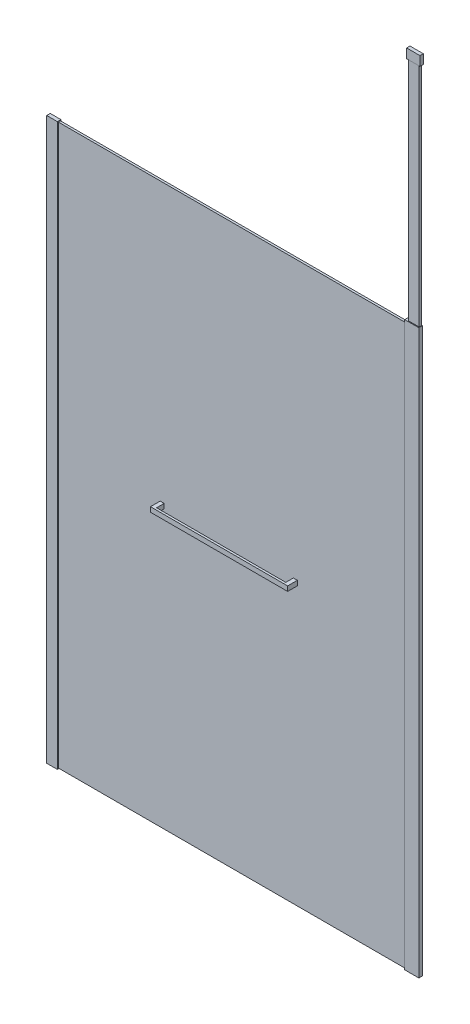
ISO-10303-21;
HEADER;
FILE_DESCRIPTION(('STEP AP214'),'2;1');
FILE_NAME('part.step','',(''),(''),'','','');
FILE_SCHEMA(('AUTOMOTIVE_DESIGN { 1 0 10303 214 1 1 1 1 }'));
ENDSEC;
DATA;
#1=APPLICATION_CONTEXT('core data for automotive mechanical design processes');
#2=APPLICATION_PROTOCOL_DEFINITION('international standard','automotive_design',2000,#1);
#3=PRODUCT_CONTEXT('',#1,'mechanical');
#4=PRODUCT('Part','Part','',(#3));
#5=PRODUCT_RELATED_PRODUCT_CATEGORY('part','',(#4));
#6=PRODUCT_DEFINITION_FORMATION('','',#4);
#7=PRODUCT_DEFINITION_CONTEXT('part definition',#1,'design');
#8=PRODUCT_DEFINITION('design','',#6,#7);
#9=PRODUCT_DEFINITION_SHAPE('','',#8);
#10=(LENGTH_UNIT() NAMED_UNIT(*) SI_UNIT(.MILLI.,.METRE.));
#11=(NAMED_UNIT(*) PLANE_ANGLE_UNIT() SI_UNIT($,.RADIAN.));
#12=(NAMED_UNIT(*) SI_UNIT($,.STERADIAN.) SOLID_ANGLE_UNIT());
#13=UNCERTAINTY_MEASURE_WITH_UNIT(LENGTH_MEASURE(1.E-05),#10,'distance_accuracy_value','');
#14=(GEOMETRIC_REPRESENTATION_CONTEXT(3) GLOBAL_UNCERTAINTY_ASSIGNED_CONTEXT((#13)) GLOBAL_UNIT_ASSIGNED_CONTEXT((#10,
#11,#12)) REPRESENTATION_CONTEXT('',''));
#15=CARTESIAN_POINT('',(0.,0.,0.));
#16=DIRECTION('',(0.,0.,1.));
#17=DIRECTION('',(1.,0.,0.));
#18=AXIS2_PLACEMENT_3D('',#15,#16,#17);
#19=CARTESIAN_POINT('',(437.5,1062.,-21.4));
#20=DIRECTION('',(1.,0.,0.));
#21=DIRECTION('',(0.,0.,-1.));
#22=AXIS2_PLACEMENT_3D('',#19,#20,#21);
#23=PLANE('',#22);
#24=DIRECTION('',(0.,1.,0.));
#25=VECTOR('',#24,1.);
#26=CARTESIAN_POINT('',(437.5,1062.,25.1));
#27=LINE('',#26,#25);
#28=CARTESIAN_POINT('',(437.5,1044.,25.1));
#29=VERTEX_POINT('',#28);
#30=CARTESIAN_POINT('',(437.5,1062.,25.1));
#31=VERTEX_POINT('',#30);
#32=EDGE_CURVE('E63',#29,#31,#27,.T.);
#33=ORIENTED_EDGE('',*,*,#32,.F.);
#34=DIRECTION('',(0.,0.,1.));
#35=VECTOR('',#34,1.);
#36=CARTESIAN_POINT('',(437.5,1044.,-21.4));
#37=LINE('',#36,#35);
#38=CARTESIAN_POINT('',(437.5,1044.,-21.4));
#39=VERTEX_POINT('',#38);
#40=EDGE_CURVE('E12',#39,#29,#37,.T.);
#41=ORIENTED_EDGE('',*,*,#40,.F.);
#42=DIRECTION('',(0.,1.,0.));
#43=VECTOR('',#42,1.);
#44=CARTESIAN_POINT('',(437.5,1062.,-21.4));
#45=LINE('',#44,#43);
#46=CARTESIAN_POINT('',(437.5,1062.,-21.4));
#47=VERTEX_POINT('',#46);
#48=EDGE_CURVE('E193',#39,#47,#45,.T.);
#49=ORIENTED_EDGE('',*,*,#48,.T.);
#50=DIRECTION('',(0.,0.,1.));
#51=VECTOR('',#50,1.);
#52=CARTESIAN_POINT('',(437.5,1062.,-21.4));
#53=LINE('',#52,#51);
#54=EDGE_CURVE('E176',#47,#31,#53,.T.);
#55=ORIENTED_EDGE('',*,*,#54,.T.);
#56=EDGE_LOOP('',(#33,#41,#49,#55));
#57=FACE_BOUND('',#56,.T.);
#58=ADVANCED_FACE('F46',(#57),#23,.T.);
#59=CARTESIAN_POINT('',(422.5,1044.,-21.4));
#60=DIRECTION('',(0.,-1.,0.));
#61=DIRECTION('',(0.,0.,-1.));
#62=AXIS2_PLACEMENT_3D('',#59,#60,#61);
#63=PLANE('',#62);
#64=ORIENTED_EDGE('',*,*,#40,.T.);
#65=DIRECTION('',(-1.,0.,0.));
#66=VECTOR('',#65,1.);
#67=CARTESIAN_POINT('',(942.197715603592,1044.,25.1));
#68=LINE('',#67,#66);
#69=CARTESIAN_POINT('',(922.5,1044.,25.1));
#70=VERTEX_POINT('',#69);
#71=EDGE_CURVE('E166',#70,#29,#68,.T.);
#72=ORIENTED_EDGE('',*,*,#71,.F.);
#73=DIRECTION('',(0.,0.,1.));
#74=VECTOR('',#73,1.);
#75=CARTESIAN_POINT('',(922.5,1044.,-21.4));
#76=LINE('',#75,#74);
#77=CARTESIAN_POINT('',(922.5,1044.,-21.4));
#78=VERTEX_POINT('',#77);
#79=EDGE_CURVE('E149',#78,#70,#76,.T.);
#80=ORIENTED_EDGE('',*,*,#79,.F.);
#81=DIRECTION('',(1.,0.,0.));
#82=VECTOR('',#81,1.);
#83=CARTESIAN_POINT('',(922.5,1044.,-21.4));
#84=LINE('',#83,#82);
#85=CARTESIAN_POINT('',(937.5,1044.,-21.4));
#86=VERTEX_POINT('',#85);
#87=EDGE_CURVE('E131',#78,#86,#84,.T.);
#88=ORIENTED_EDGE('',*,*,#87,.T.);
#89=DIRECTION('',(0.,0.,1.));
#90=VECTOR('',#89,1.);
#91=CARTESIAN_POINT('',(937.5,1044.,-21.4));
#92=LINE('',#91,#90);
#93=CARTESIAN_POINT('',(937.5,1044.,33.1));
#94=VERTEX_POINT('',#93);
#95=EDGE_CURVE('E147',#86,#94,#92,.T.);
#96=ORIENTED_EDGE('',*,*,#95,.T.);
#97=DIRECTION('',(1.,0.,0.));
#98=VECTOR('',#97,1.);
#99=CARTESIAN_POINT('',(422.5,1044.,33.1));
#100=LINE('',#99,#98);
#101=CARTESIAN_POINT('',(422.5,1044.,33.1));
#102=VERTEX_POINT('',#101);
#103=EDGE_CURVE('E135',#102,#94,#100,.T.);
#104=ORIENTED_EDGE('',*,*,#103,.F.);
#105=DIRECTION('',(0.,0.,1.));
#106=VECTOR('',#105,1.);
#107=CARTESIAN_POINT('',(422.5,1044.,-21.4));
#108=LINE('',#107,#106);
#109=CARTESIAN_POINT('',(422.5,1044.,-21.4));
#110=VERTEX_POINT('',#109);
#111=EDGE_CURVE('E55',#110,#102,#108,.T.);
#112=ORIENTED_EDGE('',*,*,#111,.F.);
#113=DIRECTION('',(1.,0.,0.));
#114=VECTOR('',#113,1.);
#115=CARTESIAN_POINT('',(422.5,1044.,-21.4));
#116=LINE('',#115,#114);
#117=EDGE_CURVE('E181',#110,#39,#116,.T.);
#118=ORIENTED_EDGE('',*,*,#117,.T.);
#119=EDGE_LOOP('',(#64,#72,#80,#88,#96,#104,#112,#118));
#120=FACE_BOUND('',#119,.T.);
#121=ADVANCED_FACE('F197',(#120),#63,.T.);
#122=CARTESIAN_POINT('',(422.5,1062.,-21.4));
#123=DIRECTION('',(-1.,0.,0.));
#124=DIRECTION('',(0.,0.,1.));
#125=AXIS2_PLACEMENT_3D('',#122,#123,#124);
#126=PLANE('',#125);
#127=ORIENTED_EDGE('',*,*,#111,.T.);
#128=DIRECTION('',(0.,-1.,0.));
#129=VECTOR('',#128,1.);
#130=CARTESIAN_POINT('',(422.5,1062.,33.1));
#131=LINE('',#130,#129);
#132=CARTESIAN_POINT('',(422.5,1062.,33.1));
#133=VERTEX_POINT('',#132);
#134=EDGE_CURVE('E121',#133,#102,#131,.T.);
#135=ORIENTED_EDGE('',*,*,#134,.F.);
#136=DIRECTION('',(0.,0.,1.));
#137=VECTOR('',#136,1.);
#138=CARTESIAN_POINT('',(422.5,1062.,-21.4));
#139=LINE('',#138,#137);
#140=CARTESIAN_POINT('',(422.5,1062.,-21.4));
#141=VERTEX_POINT('',#140);
#142=EDGE_CURVE('E116',#141,#133,#139,.T.);
#143=ORIENTED_EDGE('',*,*,#142,.F.);
#144=DIRECTION('',(0.,-1.,0.));
#145=VECTOR('',#144,1.);
#146=CARTESIAN_POINT('',(422.5,1062.,-21.4));
#147=LINE('',#146,#145);
#148=EDGE_CURVE('E186',#141,#110,#147,.T.);
#149=ORIENTED_EDGE('',*,*,#148,.T.);
#150=EDGE_LOOP('',(#127,#135,#143,#149));
#151=FACE_BOUND('',#150,.T.);
#152=ADVANCED_FACE('F218',(#151),#126,.T.);
#153=CARTESIAN_POINT('',(422.5,1062.,-21.4));
#154=DIRECTION('',(0.,1.,0.));
#155=DIRECTION('',(0.,0.,1.));
#156=AXIS2_PLACEMENT_3D('',#153,#154,#155);
#157=PLANE('',#156);
#158=ORIENTED_EDGE('',*,*,#142,.T.);
#159=DIRECTION('',(-1.,0.,0.));
#160=VECTOR('',#159,1.);
#161=CARTESIAN_POINT('',(422.5,1062.,33.1));
#162=LINE('',#161,#160);
#163=CARTESIAN_POINT('',(937.5,1062.,33.1));
#164=VERTEX_POINT('',#163);
#165=EDGE_CURVE('E109',#164,#133,#162,.T.);
#166=ORIENTED_EDGE('',*,*,#165,.F.);
#167=DIRECTION('',(0.,0.,1.));
#168=VECTOR('',#167,1.);
#169=CARTESIAN_POINT('',(937.5,1062.,-21.4));
#170=LINE('',#169,#168);
#171=CARTESIAN_POINT('',(937.5,1062.,-21.4));
#172=VERTEX_POINT('',#171);
#173=EDGE_CURVE('E113',#172,#164,#170,.T.);
#174=ORIENTED_EDGE('',*,*,#173,.F.);
#175=DIRECTION('',(-1.,0.,0.));
#176=VECTOR('',#175,1.);
#177=CARTESIAN_POINT('',(922.5,1062.,-21.4));
#178=LINE('',#177,#176);
#179=CARTESIAN_POINT('',(922.5,1062.,-21.4));
#180=VERTEX_POINT('',#179);
#181=EDGE_CURVE('E138',#172,#180,#178,.T.);
#182=ORIENTED_EDGE('',*,*,#181,.T.);
#183=DIRECTION('',(0.,0.,1.));
#184=VECTOR('',#183,1.);
#185=CARTESIAN_POINT('',(922.5,1062.,-21.4));
#186=LINE('',#185,#184);
#187=CARTESIAN_POINT('',(922.5,1062.,25.1));
#188=VERTEX_POINT('',#187);
#189=EDGE_CURVE('E130',#180,#188,#186,.T.);
#190=ORIENTED_EDGE('',*,*,#189,.T.);
#191=DIRECTION('',(-1.,0.,0.));
#192=VECTOR('',#191,1.);
#193=CARTESIAN_POINT('',(942.197715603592,1062.,25.1));
#194=LINE('',#193,#192);
#195=EDGE_CURVE('E163',#188,#31,#194,.T.);
#196=ORIENTED_EDGE('',*,*,#195,.T.);
#197=ORIENTED_EDGE('',*,*,#54,.F.);
#198=DIRECTION('',(-1.,0.,0.));
#199=VECTOR('',#198,1.);
#200=CARTESIAN_POINT('',(422.5,1062.,-21.4));
#201=LINE('',#200,#199);
#202=EDGE_CURVE('E190',#47,#141,#201,.T.);
#203=ORIENTED_EDGE('',*,*,#202,.T.);
#204=EDGE_LOOP('',(#158,#166,#174,#182,#190,#196,#197,#203));
#205=FACE_BOUND('',#204,.T.);
#206=ADVANCED_FACE('F111',(#205),#157,.T.);
#207=CARTESIAN_POINT('',(437.5,1044.,-21.4));
#208=DIRECTION('',(0.,0.,1.));
#209=DIRECTION('',(1.,0.,0.));
#210=AXIS2_PLACEMENT_3D('',#207,#208,#209);
#211=PLANE('',#210);
#212=ORIENTED_EDGE('',*,*,#48,.F.);
#213=ORIENTED_EDGE('',*,*,#117,.F.);
#214=ORIENTED_EDGE('',*,*,#148,.F.);
#215=ORIENTED_EDGE('',*,*,#202,.F.);
#216=EDGE_LOOP('',(#212,#213,#214,#215));
#217=FACE_BOUND('',#216,.T.);
#218=ADVANCED_FACE('F225',(#217),#211,.F.);
#219=CARTESIAN_POINT('',(437.5,1044.,33.1));
#220=DIRECTION('',(0.,0.,1.));
#221=DIRECTION('',(1.,0.,0.));
#222=AXIS2_PLACEMENT_3D('',#219,#220,#221);
#223=PLANE('',#222);
#224=ORIENTED_EDGE('',*,*,#103,.T.);
#225=DIRECTION('',(0.,1.,0.));
#226=VECTOR('',#225,1.);
#227=CARTESIAN_POINT('',(937.5,1062.,33.1));
#228=LINE('',#227,#226);
#229=EDGE_CURVE('E127',#94,#164,#228,.T.);
#230=ORIENTED_EDGE('',*,*,#229,.T.);
#231=ORIENTED_EDGE('',*,*,#165,.T.);
#232=ORIENTED_EDGE('',*,*,#134,.T.);
#233=EDGE_LOOP('',(#224,#230,#231,#232));
#234=FACE_BOUND('',#233,.T.);
#235=ADVANCED_FACE('F133',(#234),#223,.T.);
#236=CARTESIAN_POINT('',(942.197715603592,1062.,25.1));
#237=DIRECTION('',(0.,0.,1.));
#238=DIRECTION('',(1.,0.,0.));
#239=AXIS2_PLACEMENT_3D('',#236,#237,#238);
#240=PLANE('',#239);
#241=ORIENTED_EDGE('',*,*,#195,.F.);
#242=DIRECTION('',(0.,-1.,0.));
#243=VECTOR('',#242,1.);
#244=CARTESIAN_POINT('',(922.5,1062.,25.1));
#245=LINE('',#244,#243);
#246=EDGE_CURVE('E49',#188,#70,#245,.T.);
#247=ORIENTED_EDGE('',*,*,#246,.T.);
#248=ORIENTED_EDGE('',*,*,#71,.T.);
#249=ORIENTED_EDGE('',*,*,#32,.T.);
#250=EDGE_LOOP('',(#241,#247,#248,#249));
#251=FACE_BOUND('',#250,.T.);
#252=ADVANCED_FACE('F203',(#251),#240,.F.);
#253=CARTESIAN_POINT('',(922.5,1062.,-21.4));
#254=DIRECTION('',(-1.,0.,0.));
#255=DIRECTION('',(0.,0.,1.));
#256=AXIS2_PLACEMENT_3D('',#253,#254,#255);
#257=PLANE('',#256);
#258=ORIENTED_EDGE('',*,*,#246,.F.);
#259=ORIENTED_EDGE('',*,*,#189,.F.);
#260=DIRECTION('',(0.,-1.,0.));
#261=VECTOR('',#260,1.);
#262=CARTESIAN_POINT('',(922.5,1062.,-21.4));
#263=LINE('',#262,#261);
#264=EDGE_CURVE('E142',#180,#78,#263,.T.);
#265=ORIENTED_EDGE('',*,*,#264,.T.);
#266=ORIENTED_EDGE('',*,*,#79,.T.);
#267=EDGE_LOOP('',(#258,#259,#265,#266));
#268=FACE_BOUND('',#267,.T.);
#269=ADVANCED_FACE('F204',(#268),#257,.T.);
#270=CARTESIAN_POINT('',(937.5,1062.,-21.4));
#271=DIRECTION('',(1.,0.,0.));
#272=DIRECTION('',(0.,0.,-1.));
#273=AXIS2_PLACEMENT_3D('',#270,#271,#272);
#274=PLANE('',#273);
#275=ORIENTED_EDGE('',*,*,#173,.T.);
#276=ORIENTED_EDGE('',*,*,#229,.F.);
#277=ORIENTED_EDGE('',*,*,#95,.F.);
#278=DIRECTION('',(0.,1.,0.));
#279=VECTOR('',#278,1.);
#280=CARTESIAN_POINT('',(937.5,1062.,-21.4));
#281=LINE('',#280,#279);
#282=EDGE_CURVE('E129',#86,#172,#281,.T.);
#283=ORIENTED_EDGE('',*,*,#282,.T.);
#284=EDGE_LOOP('',(#275,#276,#277,#283));
#285=FACE_BOUND('',#284,.T.);
#286=ADVANCED_FACE('F126',(#285),#274,.T.);
#287=CARTESIAN_POINT('',(937.5,1044.,-21.4));
#288=DIRECTION('',(0.,0.,1.));
#289=DIRECTION('',(1.,0.,0.));
#290=AXIS2_PLACEMENT_3D('',#287,#288,#289);
#291=PLANE('',#290);
#292=ORIENTED_EDGE('',*,*,#282,.F.);
#293=ORIENTED_EDGE('',*,*,#87,.F.);
#294=ORIENTED_EDGE('',*,*,#264,.F.);
#295=ORIENTED_EDGE('',*,*,#181,.F.);
#296=EDGE_LOOP('',(#292,#293,#294,#295));
#297=FACE_BOUND('',#296,.T.);
#298=ADVANCED_FACE('F200',(#297),#291,.F.);
#299=CLOSED_SHELL('',(#58,#121,#152,#206,#218,#235,#252,#269,#286,#298));
#300=MANIFOLD_SOLID_BREP('B2',#299);
#301=CARTESIAN_POINT('',(1349.9,3000.,-1.15000000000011));
#302=DIRECTION('',(1.,0.,0.));
#303=DIRECTION('',(0.,1.,0.));
#304=AXIS2_PLACEMENT_3D('',#301,#302,#303);
#305=PLANE('',#304);
#306=DIRECTION('',(0.,0.,1.));
#307=VECTOR('',#306,1.);
#308=CARTESIAN_POINT('',(1349.9,2965.,-1.1500000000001));
#309=LINE('',#308,#307);
#310=CARTESIAN_POINT('',(1349.9,2965.,-13.6500000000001));
#311=VERTEX_POINT('',#310);
#312=CARTESIAN_POINT('',(1349.9,2965.,-1.1500000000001));
#313=VERTEX_POINT('',#312);
#314=EDGE_CURVE('E406',#311,#313,#309,.T.);
#315=ORIENTED_EDGE('',*,*,#314,.T.);
#316=DIRECTION('',(0.,-1.,0.));
#317=VECTOR('',#316,1.);
#318=CARTESIAN_POINT('',(1349.9,3000.,-1.15000000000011));
#319=LINE('',#318,#317);
#320=CARTESIAN_POINT('',(1349.9,3000.,-1.15000000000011));
#321=VERTEX_POINT('',#320);
#322=EDGE_CURVE('E387',#321,#313,#319,.T.);
#323=ORIENTED_EDGE('',*,*,#322,.F.);
#324=DIRECTION('',(0.,0.,1.));
#325=VECTOR('',#324,1.);
#326=CARTESIAN_POINT('',(1349.9,3000.,-1.15000000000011));
#327=LINE('',#326,#325);
#328=CARTESIAN_POINT('',(1349.9,3000.,-13.6500000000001));
#329=VERTEX_POINT('',#328);
#330=EDGE_CURVE('E394',#329,#321,#327,.T.);
#331=ORIENTED_EDGE('',*,*,#330,.F.);
#332=DIRECTION('',(0.,-1.,0.));
#333=VECTOR('',#332,1.);
#334=CARTESIAN_POINT('',(1349.9,3000.,-13.6500000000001));
#335=LINE('',#334,#333);
#336=EDGE_CURVE('E545',#329,#311,#335,.T.);
#337=ORIENTED_EDGE('',*,*,#336,.T.);
#338=EDGE_LOOP('',(#315,#323,#331,#337));
#339=FACE_BOUND('',#338,.T.);
#340=ADVANCED_FACE('F318',(#339),#305,.F.);
#341=CARTESIAN_POINT('',(1399.9,3000.,-1.1500000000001));
#342=DIRECTION('',(0.,0.,-1.));
#343=DIRECTION('',(-1.,0.,0.));
#344=AXIS2_PLACEMENT_3D('',#341,#342,#343);
#345=PLANE('',#344);
#346=DIRECTION('',(1.,0.,0.));
#347=VECTOR('',#346,1.);
#348=CARTESIAN_POINT('',(1399.9,2965.,-1.1500000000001));
#349=LINE('',#348,#347);
#350=CARTESIAN_POINT('',(1399.9,2965.,-1.1500000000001));
#351=VERTEX_POINT('',#350);
#352=EDGE_CURVE('E543',#313,#351,#349,.T.);
#353=ORIENTED_EDGE('',*,*,#352,.T.);
#354=DIRECTION('',(0.,-1.,0.));
#355=VECTOR('',#354,1.);
#356=CARTESIAN_POINT('',(1399.9,3000.,-1.1500000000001));
#357=LINE('',#356,#355);
#358=CARTESIAN_POINT('',(1399.9,3000.,-1.1500000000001));
#359=VERTEX_POINT('',#358);
#360=EDGE_CURVE('E390',#359,#351,#357,.T.);
#361=ORIENTED_EDGE('',*,*,#360,.F.);
#362=DIRECTION('',(1.,0.,0.));
#363=VECTOR('',#362,1.);
#364=CARTESIAN_POINT('',(1399.9,3000.,-1.1500000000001));
#365=LINE('',#364,#363);
#366=EDGE_CURVE('E383',#321,#359,#365,.T.);
#367=ORIENTED_EDGE('',*,*,#366,.F.);
#368=ORIENTED_EDGE('',*,*,#322,.T.);
#369=EDGE_LOOP('',(#353,#361,#367,#368));
#370=FACE_BOUND('',#369,.T.);
#371=ADVANCED_FACE('F385',(#370),#345,.F.);
#372=CARTESIAN_POINT('',(1399.9,3000.,-1.1500000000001));
#373=DIRECTION('',(-1.,0.,0.));
#374=DIRECTION('',(0.,-1.,0.));
#375=AXIS2_PLACEMENT_3D('',#372,#373,#374);
#376=PLANE('',#375);
#377=DIRECTION('',(0.,0.,-1.));
#378=VECTOR('',#377,1.);
#379=CARTESIAN_POINT('',(1399.9,2965.,-1.1500000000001));
#380=LINE('',#379,#378);
#381=CARTESIAN_POINT('',(1399.9,2965.,-13.6500000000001));
#382=VERTEX_POINT('',#381);
#383=EDGE_CURVE('E539',#351,#382,#380,.T.);
#384=ORIENTED_EDGE('',*,*,#383,.T.);
#385=DIRECTION('',(0.,-1.,0.));
#386=VECTOR('',#385,1.);
#387=CARTESIAN_POINT('',(1399.9,3000.,-13.6500000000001));
#388=LINE('',#387,#386);
#389=CARTESIAN_POINT('',(1399.9,3000.,-13.6500000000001));
#390=VERTEX_POINT('',#389);
#391=EDGE_CURVE('E410',#390,#382,#388,.T.);
#392=ORIENTED_EDGE('',*,*,#391,.F.);
#393=DIRECTION('',(0.,0.,-1.));
#394=VECTOR('',#393,1.);
#395=CARTESIAN_POINT('',(1399.9,3000.,-1.1500000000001));
#396=LINE('',#395,#394);
#397=EDGE_CURVE('E393',#359,#390,#396,.T.);
#398=ORIENTED_EDGE('',*,*,#397,.F.);
#399=ORIENTED_EDGE('',*,*,#360,.T.);
#400=EDGE_LOOP('',(#384,#392,#398,#399));
#401=FACE_BOUND('',#400,.T.);
#402=ADVANCED_FACE('F460',(#401),#376,.F.);
#403=CARTESIAN_POINT('',(1399.9,3000.,-13.6500000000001));
#404=DIRECTION('',(0.,0.,1.));
#405=DIRECTION('',(1.,0.,0.));
#406=AXIS2_PLACEMENT_3D('',#403,#404,#405);
#407=PLANE('',#406);
#408=DIRECTION('',(-1.,0.,0.));
#409=VECTOR('',#408,1.);
#410=CARTESIAN_POINT('',(1399.9,2965.,-13.6500000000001));
#411=LINE('',#410,#409);
#412=EDGE_CURVE('E403',#382,#311,#411,.T.);
#413=ORIENTED_EDGE('',*,*,#412,.T.);
#414=ORIENTED_EDGE('',*,*,#336,.F.);
#415=DIRECTION('',(-1.,0.,0.));
#416=VECTOR('',#415,1.);
#417=CARTESIAN_POINT('',(1399.9,3000.,-13.6500000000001));
#418=LINE('',#417,#416);
#419=EDGE_CURVE('E399',#390,#329,#418,.T.);
#420=ORIENTED_EDGE('',*,*,#419,.F.);
#421=ORIENTED_EDGE('',*,*,#391,.T.);
#422=EDGE_LOOP('',(#413,#414,#420,#421));
#423=FACE_BOUND('',#422,.T.);
#424=ADVANCED_FACE('F507',(#423),#407,.F.);
#425=CARTESIAN_POINT('',(1349.9,3000.,-13.6500000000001));
#426=DIRECTION('',(0.,1.,0.));
#427=DIRECTION('',(0.,0.,1.));
#428=AXIS2_PLACEMENT_3D('',#425,#426,#427);
#429=PLANE('',#428);
#430=ORIENTED_EDGE('',*,*,#330,.T.);
#431=ORIENTED_EDGE('',*,*,#366,.T.);
#432=ORIENTED_EDGE('',*,*,#397,.T.);
#433=ORIENTED_EDGE('',*,*,#419,.T.);
#434=EDGE_LOOP('',(#430,#431,#432,#433));
#435=FACE_BOUND('',#434,.T.);
#436=ADVANCED_FACE('F397',(#435),#429,.T.);
#437=CARTESIAN_POINT('',(1349.9,2965.,-13.6500000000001));
#438=DIRECTION('',(0.,1.,0.));
#439=DIRECTION('',(0.,0.,1.));
#440=AXIS2_PLACEMENT_3D('',#437,#438,#439);
#441=PLANE('',#440);
#442=DIRECTION('',(0.,0.,1.));
#443=VECTOR('',#442,1.);
#444=CARTESIAN_POINT('',(1394.9,2965.,-11.4000000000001));
#445=LINE('',#444,#443);
#446=CARTESIAN_POINT('',(1394.9,2965.,-11.4000000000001));
#447=VERTEX_POINT('',#446);
#448=CARTESIAN_POINT('',(1394.9,2965.,-3.40000000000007));
#449=VERTEX_POINT('',#448);
#450=EDGE_CURVE('E415',#447,#449,#445,.T.);
#451=ORIENTED_EDGE('',*,*,#450,.F.);
#452=DIRECTION('',(1.,0.,0.));
#453=VECTOR('',#452,1.);
#454=CARTESIAN_POINT('',(1394.9,2965.,-11.4000000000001));
#455=LINE('',#454,#453);
#456=CARTESIAN_POINT('',(1354.9,2965.,-11.4000000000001));
#457=VERTEX_POINT('',#456);
#458=EDGE_CURVE('E408',#457,#447,#455,.T.);
#459=ORIENTED_EDGE('',*,*,#458,.F.);
#460=DIRECTION('',(0.,0.,-1.));
#461=VECTOR('',#460,1.);
#462=CARTESIAN_POINT('',(1354.9,2965.,-11.4000000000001));
#463=LINE('',#462,#461);
#464=CARTESIAN_POINT('',(1354.9,2965.,-3.40000000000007));
#465=VERTEX_POINT('',#464);
#466=EDGE_CURVE('E333',#465,#457,#463,.T.);
#467=ORIENTED_EDGE('',*,*,#466,.F.);
#468=DIRECTION('',(-1.,0.,0.));
#469=VECTOR('',#468,1.);
#470=CARTESIAN_POINT('',(1394.9,2965.,-3.40000000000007));
#471=LINE('',#470,#469);
#472=EDGE_CURVE('E44',#449,#465,#471,.T.);
#473=ORIENTED_EDGE('',*,*,#472,.F.);
#474=EDGE_LOOP('',(#451,#459,#467,#473));
#475=FACE_BOUND('',#474,.T.);
#476=ORIENTED_EDGE('',*,*,#314,.F.);
#477=ORIENTED_EDGE('',*,*,#412,.F.);
#478=ORIENTED_EDGE('',*,*,#383,.F.);
#479=ORIENTED_EDGE('',*,*,#352,.F.);
#480=EDGE_LOOP('',(#476,#477,#478,#479));
#481=FACE_BOUND('',#480,.T.);
#482=ADVANCED_FACE('F490',(#475,#481),#441,.F.);
#483=CARTESIAN_POINT('',(1394.9,2997.,-11.4000000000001));
#484=DIRECTION('',(1.,0.,0.));
#485=DIRECTION('',(0.,0.,-1.));
#486=AXIS2_PLACEMENT_3D('',#483,#484,#485);
#487=PLANE('',#486);
#488=DIRECTION('',(0.,-1.,0.));
#489=VECTOR('',#488,1.);
#490=CARTESIAN_POINT('',(1394.9,2997.,-11.4000000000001));
#491=LINE('',#490,#489);
#492=CARTESIAN_POINT('',(1394.9,2114.,-11.4000000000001));
#493=VERTEX_POINT('',#492);
#494=EDGE_CURVE('E326',#447,#493,#491,.T.);
#495=ORIENTED_EDGE('',*,*,#494,.F.);
#496=ORIENTED_EDGE('',*,*,#450,.T.);
#497=DIRECTION('',(0.,-1.,0.));
#498=VECTOR('',#497,1.);
#499=CARTESIAN_POINT('',(1394.9,2997.,-3.40000000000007));
#500=LINE('',#499,#498);
#501=CARTESIAN_POINT('',(1394.9,2114.,-3.40000000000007));
#502=VERTEX_POINT('',#501);
#503=EDGE_CURVE('E430',#449,#502,#500,.T.);
#504=ORIENTED_EDGE('',*,*,#503,.T.);
#505=DIRECTION('',(0.,0.,1.));
#506=VECTOR('',#505,1.);
#507=CARTESIAN_POINT('',(1394.9,2114.,-11.4000000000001));
#508=LINE('',#507,#506);
#509=EDGE_CURVE('E418',#493,#502,#508,.T.);
#510=ORIENTED_EDGE('',*,*,#509,.F.);
#511=EDGE_LOOP('',(#495,#496,#504,#510));
#512=FACE_BOUND('',#511,.T.);
#513=ADVANCED_FACE('F320',(#512),#487,.T.);
#514=CARTESIAN_POINT('',(1394.9,2997.,-11.4000000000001));
#515=DIRECTION('',(0.,0.,-1.));
#516=DIRECTION('',(-1.,0.,0.));
#517=AXIS2_PLACEMENT_3D('',#514,#515,#516);
#518=PLANE('',#517);
#519=DIRECTION('',(0.,-1.,0.));
#520=VECTOR('',#519,1.);
#521=CARTESIAN_POINT('',(1354.9,2997.,-11.4000000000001));
#522=LINE('',#521,#520);
#523=CARTESIAN_POINT('',(1354.9,2114.,-11.4000000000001));
#524=VERTEX_POINT('',#523);
#525=EDGE_CURVE('E432',#457,#524,#522,.T.);
#526=ORIENTED_EDGE('',*,*,#525,.F.);
#527=ORIENTED_EDGE('',*,*,#458,.T.);
#528=ORIENTED_EDGE('',*,*,#494,.T.);
#529=DIRECTION('',(1.,0.,0.));
#530=VECTOR('',#529,1.);
#531=CARTESIAN_POINT('',(1394.9,2114.,-11.4000000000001));
#532=LINE('',#531,#530);
#533=EDGE_CURVE('E427',#524,#493,#532,.T.);
#534=ORIENTED_EDGE('',*,*,#533,.F.);
#535=EDGE_LOOP('',(#526,#527,#528,#534));
#536=FACE_BOUND('',#535,.T.);
#537=ADVANCED_FACE('F445',(#536),#518,.T.);
#538=CARTESIAN_POINT('',(1354.9,2997.,-11.4000000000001));
#539=DIRECTION('',(-1.,0.,0.));
#540=DIRECTION('',(0.,0.,1.));
#541=AXIS2_PLACEMENT_3D('',#538,#539,#540);
#542=PLANE('',#541);
#543=DIRECTION('',(0.,-1.,0.));
#544=VECTOR('',#543,1.);
#545=CARTESIAN_POINT('',(1354.9,2997.,-3.40000000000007));
#546=LINE('',#545,#544);
#547=CARTESIAN_POINT('',(1354.9,2114.,-3.40000000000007));
#548=VERTEX_POINT('',#547);
#549=EDGE_CURVE('E434',#465,#548,#546,.T.);
#550=ORIENTED_EDGE('',*,*,#549,.F.);
#551=ORIENTED_EDGE('',*,*,#466,.T.);
#552=ORIENTED_EDGE('',*,*,#525,.T.);
#553=DIRECTION('',(0.,0.,-1.));
#554=VECTOR('',#553,1.);
#555=CARTESIAN_POINT('',(1354.9,2114.,-11.4000000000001));
#556=LINE('',#555,#554);
#557=EDGE_CURVE('E424',#548,#524,#556,.T.);
#558=ORIENTED_EDGE('',*,*,#557,.F.);
#559=EDGE_LOOP('',(#550,#551,#552,#558));
#560=FACE_BOUND('',#559,.T.);
#561=ADVANCED_FACE('F447',(#560),#542,.T.);
#562=CARTESIAN_POINT('',(1394.9,2997.,-3.40000000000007));
#563=DIRECTION('',(0.,0.,1.));
#564=DIRECTION('',(1.,0.,0.));
#565=AXIS2_PLACEMENT_3D('',#562,#563,#564);
#566=PLANE('',#565);
#567=ORIENTED_EDGE('',*,*,#503,.F.);
#568=ORIENTED_EDGE('',*,*,#472,.T.);
#569=ORIENTED_EDGE('',*,*,#549,.T.);
#570=DIRECTION('',(-1.,0.,0.));
#571=VECTOR('',#570,1.);
#572=CARTESIAN_POINT('',(1394.9,2114.,-3.40000000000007));
#573=LINE('',#572,#571);
#574=EDGE_CURVE('E421',#502,#548,#573,.T.);
#575=ORIENTED_EDGE('',*,*,#574,.F.);
#576=EDGE_LOOP('',(#567,#568,#569,#575));
#577=FACE_BOUND('',#576,.T.);
#578=ADVANCED_FACE('F439',(#577),#566,.T.);
#579=CARTESIAN_POINT('',(1394.9,2114.,-3.40000000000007));
#580=DIRECTION('',(0.,-1.,0.));
#581=DIRECTION('',(0.,0.,-1.));
#582=AXIS2_PLACEMENT_3D('',#579,#580,#581);
#583=PLANE('',#582);
#584=ORIENTED_EDGE('',*,*,#509,.T.);
#585=ORIENTED_EDGE('',*,*,#574,.T.);
#586=ORIENTED_EDGE('',*,*,#557,.T.);
#587=ORIENTED_EDGE('',*,*,#533,.T.);
#588=EDGE_LOOP('',(#584,#585,#586,#587));
#589=FACE_BOUND('',#588,.T.);
#590=ADVANCED_FACE('F443',(#589),#583,.T.);
#591=CLOSED_SHELL('',(#340,#371,#402,#424,#436,#482,#513,#537,#561,#578,#590));
#592=MANIFOLD_SOLID_BREP('B6',#591);
#593=CARTESIAN_POINT('',(1353.5,2111.,-3.39999999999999));
#594=DIRECTION('',(0.,0.,-1.));
#595=DIRECTION('',(-1.,0.,0.));
#596=AXIS2_PLACEMENT_3D('',#593,#594,#595);
#597=PLANE('',#596);
#598=DIRECTION('',(-1.,0.,0.));
#599=VECTOR('',#598,1.);
#600=CARTESIAN_POINT('',(1353.5,2103.2,-3.39999999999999));
#601=LINE('',#600,#599);
#602=CARTESIAN_POINT('',(1353.5,2103.2,-3.39999999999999));
#603=VERTEX_POINT('',#602);
#604=CARTESIAN_POINT('',(1343.4,2103.2,-3.39999999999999));
#605=VERTEX_POINT('',#604);
#606=EDGE_CURVE('E672',#603,#605,#601,.T.);
#607=ORIENTED_EDGE('',*,*,#606,.F.);
#608=DIRECTION('',(0.,-1.,0.));
#609=VECTOR('',#608,1.);
#610=CARTESIAN_POINT('',(1353.5,2111.,-3.39999999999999));
#611=LINE('',#610,#609);
#612=CARTESIAN_POINT('',(1353.5,3.,-3.39999999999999));
#613=VERTEX_POINT('',#612);
#614=EDGE_CURVE('E695',#603,#613,#611,.T.);
#615=ORIENTED_EDGE('',*,*,#614,.T.);
#616=DIRECTION('',(1.,0.,0.));
#617=VECTOR('',#616,1.);
#618=CARTESIAN_POINT('',(1353.5,3.,-3.39999999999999));
#619=LINE('',#618,#617);
#620=CARTESIAN_POINT('',(1343.4,3.,-3.39999999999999));
#621=VERTEX_POINT('',#620);
#622=EDGE_CURVE('E683',#621,#613,#619,.T.);
#623=ORIENTED_EDGE('',*,*,#622,.F.);
#624=DIRECTION('',(0.,-1.,0.));
#625=VECTOR('',#624,1.);
#626=CARTESIAN_POINT('',(1343.4,2111.,-3.39999999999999));
#627=LINE('',#626,#625);
#628=EDGE_CURVE('E575',#605,#621,#627,.T.);
#629=ORIENTED_EDGE('',*,*,#628,.F.);
#630=EDGE_LOOP('',(#607,#615,#623,#629));
#631=FACE_BOUND('',#630,.T.);
#632=ADVANCED_FACE('F567',(#631),#597,.T.);
#633=CARTESIAN_POINT('',(1343.4,2111.,-3.39999999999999));
#634=DIRECTION('',(-1.,0.,0.));
#635=DIRECTION('',(0.,0.,1.));
#636=AXIS2_PLACEMENT_3D('',#633,#634,#635);
#637=PLANE('',#636);
#638=DIRECTION('',(0.,-1.,0.));
#639=VECTOR('',#638,1.);
#640=CARTESIAN_POINT('',(1343.4,2111.,-14.4));
#641=LINE('',#640,#639);
#642=CARTESIAN_POINT('',(1343.4,2114.,-14.4));
#643=VERTEX_POINT('',#642);
#644=CARTESIAN_POINT('',(1343.4,0.,-14.4));
#645=VERTEX_POINT('',#644);
#646=EDGE_CURVE('E635',#643,#645,#641,.T.);
#647=ORIENTED_EDGE('',*,*,#646,.T.);
#648=DIRECTION('',(0.,0.,-1.));
#649=VECTOR('',#648,1.);
#650=CARTESIAN_POINT('',(1343.4,0.,-0.399999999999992));
#651=LINE('',#650,#649);
#652=CARTESIAN_POINT('',(1343.4,0.,-0.399999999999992));
#653=VERTEX_POINT('',#652);
#654=EDGE_CURVE('E639',#653,#645,#651,.T.);
#655=ORIENTED_EDGE('',*,*,#654,.F.);
#656=DIRECTION('',(0.,-1.,0.));
#657=VECTOR('',#656,1.);
#658=CARTESIAN_POINT('',(1343.4,2111.,-0.399999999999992));
#659=LINE('',#658,#657);
#660=CARTESIAN_POINT('',(1343.4,2114.,-0.399999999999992));
#661=VERTEX_POINT('',#660);
#662=EDGE_CURVE('E690',#661,#653,#659,.T.);
#663=ORIENTED_EDGE('',*,*,#662,.F.);
#664=DIRECTION('',(0.,0.,1.));
#665=VECTOR('',#664,1.);
#666=CARTESIAN_POINT('',(1343.4,2114.,-14.4));
#667=LINE('',#666,#665);
#668=EDGE_CURVE('E641',#643,#661,#667,.T.);
#669=ORIENTED_EDGE('',*,*,#668,.F.);
#670=EDGE_LOOP('',(#647,#655,#663,#669));
#671=FACE_BOUND('',#670,.T.);
#672=DIRECTION('',(0.,0.,1.));
#673=VECTOR('',#672,1.);
#674=CARTESIAN_POINT('',(1343.4,2103.2,-3.34999999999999));
#675=LINE('',#674,#673);
#676=CARTESIAN_POINT('',(1343.4,2103.2,-11.4));
#677=VERTEX_POINT('',#676);
#678=EDGE_CURVE('E666',#677,#605,#675,.T.);
#679=ORIENTED_EDGE('',*,*,#678,.T.);
#680=ORIENTED_EDGE('',*,*,#628,.T.);
#681=DIRECTION('',(0.,0.,-1.));
#682=VECTOR('',#681,1.);
#683=CARTESIAN_POINT('',(1343.4,3.,-0.399999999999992));
#684=LINE('',#683,#682);
#685=CARTESIAN_POINT('',(1343.4,3.,-11.4));
#686=VERTEX_POINT('',#685);
#687=EDGE_CURVE('E660',#621,#686,#684,.T.);
#688=ORIENTED_EDGE('',*,*,#687,.T.);
#689=DIRECTION('',(0.,-1.,0.));
#690=VECTOR('',#689,1.);
#691=CARTESIAN_POINT('',(1343.4,2111.,-11.4));
#692=LINE('',#691,#690);
#693=EDGE_CURVE('E646',#677,#686,#692,.T.);
#694=ORIENTED_EDGE('',*,*,#693,.F.);
#695=EDGE_LOOP('',(#679,#680,#688,#694));
#696=FACE_BOUND('',#695,.T.);
#697=ADVANCED_FACE('F637',(#671,#696),#637,.T.);
#698=CARTESIAN_POINT('',(1343.4,2111.,-0.399999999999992));
#699=DIRECTION('',(0.,0.,1.));
#700=DIRECTION('',(1.,0.,0.));
#701=AXIS2_PLACEMENT_3D('',#698,#699,#700);
#702=PLANE('',#701);
#703=ORIENTED_EDGE('',*,*,#662,.T.);
#704=DIRECTION('',(-1.,0.,0.));
#705=VECTOR('',#704,1.);
#706=CARTESIAN_POINT('',(1343.4,0.,-0.399999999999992));
#707=LINE('',#706,#705);
#708=CARTESIAN_POINT('',(1396.4,0.,-0.399999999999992));
#709=VERTEX_POINT('',#708);
#710=EDGE_CURVE('E659',#709,#653,#707,.T.);
#711=ORIENTED_EDGE('',*,*,#710,.F.);
#712=DIRECTION('',(0.,-1.,0.));
#713=VECTOR('',#712,1.);
#714=CARTESIAN_POINT('',(1396.4,2111.,-0.399999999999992));
#715=LINE('',#714,#713);
#716=CARTESIAN_POINT('',(1396.4,2114.,-0.399999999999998));
#717=VERTEX_POINT('',#716);
#718=EDGE_CURVE('E782',#717,#709,#715,.T.);
#719=ORIENTED_EDGE('',*,*,#718,.F.);
#720=DIRECTION('',(1.,0.,0.));
#721=VECTOR('',#720,1.);
#722=CARTESIAN_POINT('',(1396.4,2114.,-0.399999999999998));
#723=LINE('',#722,#721);
#724=EDGE_CURVE('E680',#661,#717,#723,.T.);
#725=ORIENTED_EDGE('',*,*,#724,.F.);
#726=EDGE_LOOP('',(#703,#711,#719,#725));
#727=FACE_BOUND('',#726,.T.);
#728=ADVANCED_FACE('F723',(#727),#702,.T.);
#729=CARTESIAN_POINT('',(1396.4,2111.,-0.399999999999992));
#730=DIRECTION('',(1.,0.,0.));
#731=DIRECTION('',(0.,0.,-1.));
#732=AXIS2_PLACEMENT_3D('',#729,#730,#731);
#733=PLANE('',#732);
#734=ORIENTED_EDGE('',*,*,#718,.T.);
#735=DIRECTION('',(0.,0.,1.));
#736=VECTOR('',#735,1.);
#737=CARTESIAN_POINT('',(1396.4,0.,-0.399999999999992));
#738=LINE('',#737,#736);
#739=CARTESIAN_POINT('',(1396.4,0.,-14.4));
#740=VERTEX_POINT('',#739);
#741=EDGE_CURVE('E654',#740,#709,#738,.T.);
#742=ORIENTED_EDGE('',*,*,#741,.F.);
#743=DIRECTION('',(0.,-1.,0.));
#744=VECTOR('',#743,1.);
#745=CARTESIAN_POINT('',(1396.4,2111.,-14.4));
#746=LINE('',#745,#744);
#747=CARTESIAN_POINT('',(1396.4,2114.,-14.4));
#748=VERTEX_POINT('',#747);
#749=EDGE_CURVE('E645',#748,#740,#746,.T.);
#750=ORIENTED_EDGE('',*,*,#749,.F.);
#751=DIRECTION('',(0.,0.,-1.));
#752=VECTOR('',#751,1.);
#753=CARTESIAN_POINT('',(1396.4,2114.,-14.4));
#754=LINE('',#753,#752);
#755=EDGE_CURVE('E674',#717,#748,#754,.T.);
#756=ORIENTED_EDGE('',*,*,#755,.F.);
#757=EDGE_LOOP('',(#734,#742,#750,#756));
#758=FACE_BOUND('',#757,.T.);
#759=ADVANCED_FACE('F728',(#758),#733,.T.);
#760=CARTESIAN_POINT('',(1396.4,2111.,-14.4));
#761=DIRECTION('',(0.,0.,-1.));
#762=DIRECTION('',(-1.,0.,0.));
#763=AXIS2_PLACEMENT_3D('',#760,#761,#762);
#764=PLANE('',#763);
#765=ORIENTED_EDGE('',*,*,#749,.T.);
#766=DIRECTION('',(1.,0.,0.));
#767=VECTOR('',#766,1.);
#768=CARTESIAN_POINT('',(1343.4,0.,-14.4));
#769=LINE('',#768,#767);
#770=EDGE_CURVE('E649',#645,#740,#769,.T.);
#771=ORIENTED_EDGE('',*,*,#770,.F.);
#772=ORIENTED_EDGE('',*,*,#646,.F.);
#773=DIRECTION('',(-1.,0.,0.));
#774=VECTOR('',#773,1.);
#775=CARTESIAN_POINT('',(1396.4,2114.,-14.4));
#776=LINE('',#775,#774);
#777=EDGE_CURVE('E677',#748,#643,#776,.T.);
#778=ORIENTED_EDGE('',*,*,#777,.F.);
#779=EDGE_LOOP('',(#765,#771,#772,#778));
#780=FACE_BOUND('',#779,.T.);
#781=ADVANCED_FACE('F650',(#780),#764,.T.);
#782=CARTESIAN_POINT('',(1343.4,2111.,-11.4));
#783=DIRECTION('',(0.,0.,1.));
#784=DIRECTION('',(1.,0.,0.));
#785=AXIS2_PLACEMENT_3D('',#782,#783,#784);
#786=PLANE('',#785);
#787=DIRECTION('',(1.,0.,0.));
#788=VECTOR('',#787,1.);
#789=CARTESIAN_POINT('',(1343.4,2103.2,-11.4));
#790=LINE('',#789,#788);
#791=CARTESIAN_POINT('',(1353.5,2103.2,-11.4));
#792=VERTEX_POINT('',#791);
#793=EDGE_CURVE('E670',#677,#792,#790,.T.);
#794=ORIENTED_EDGE('',*,*,#793,.F.);
#795=ORIENTED_EDGE('',*,*,#693,.T.);
#796=DIRECTION('',(-1.,0.,0.));
#797=VECTOR('',#796,1.);
#798=CARTESIAN_POINT('',(1343.4,3.,-11.4));
#799=LINE('',#798,#797);
#800=CARTESIAN_POINT('',(1353.5,3.,-11.4));
#801=VERTEX_POINT('',#800);
#802=EDGE_CURVE('E687',#801,#686,#799,.T.);
#803=ORIENTED_EDGE('',*,*,#802,.F.);
#804=DIRECTION('',(0.,-1.,0.));
#805=VECTOR('',#804,1.);
#806=CARTESIAN_POINT('',(1353.5,2111.,-11.4));
#807=LINE('',#806,#805);
#808=EDGE_CURVE('E590',#792,#801,#807,.T.);
#809=ORIENTED_EDGE('',*,*,#808,.F.);
#810=EDGE_LOOP('',(#794,#795,#803,#809));
#811=FACE_BOUND('',#810,.T.);
#812=ADVANCED_FACE('F709',(#811),#786,.T.);
#813=CARTESIAN_POINT('',(1353.5,2111.,-11.4));
#814=DIRECTION('',(-1.,0.,0.));
#815=DIRECTION('',(0.,0.,1.));
#816=AXIS2_PLACEMENT_3D('',#813,#814,#815);
#817=PLANE('',#816);
#818=DIRECTION('',(0.,0.,1.));
#819=VECTOR('',#818,1.);
#820=CARTESIAN_POINT('',(1353.5,2103.2,-11.4));
#821=LINE('',#820,#819);
#822=EDGE_CURVE('E316',#792,#603,#821,.T.);
#823=ORIENTED_EDGE('',*,*,#822,.F.);
#824=ORIENTED_EDGE('',*,*,#808,.T.);
#825=DIRECTION('',(0.,0.,-1.));
#826=VECTOR('',#825,1.);
#827=CARTESIAN_POINT('',(1353.5,3.,-11.4));
#828=LINE('',#827,#826);
#829=EDGE_CURVE('E684',#613,#801,#828,.T.);
#830=ORIENTED_EDGE('',*,*,#829,.F.);
#831=ORIENTED_EDGE('',*,*,#614,.F.);
#832=EDGE_LOOP('',(#823,#824,#830,#831));
#833=FACE_BOUND('',#832,.T.);
#834=ADVANCED_FACE('F706',(#833),#817,.T.);
#835=CARTESIAN_POINT('',(1396.4,2114.,-0.399999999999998));
#836=DIRECTION('',(0.,-1.,0.));
#837=DIRECTION('',(0.,0.,-1.));
#838=AXIS2_PLACEMENT_3D('',#835,#836,#837);
#839=PLANE('',#838);
#840=ORIENTED_EDGE('',*,*,#755,.T.);
#841=ORIENTED_EDGE('',*,*,#777,.T.);
#842=ORIENTED_EDGE('',*,*,#668,.T.);
#843=ORIENTED_EDGE('',*,*,#724,.T.);
#844=EDGE_LOOP('',(#840,#841,#842,#843));
#845=FACE_BOUND('',#844,.T.);
#846=ADVANCED_FACE('F708',(#845),#839,.F.);
#847=CARTESIAN_POINT('',(1358.4,2103.2,-3.34999999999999));
#848=DIRECTION('',(0.,-1.,0.));
#849=DIRECTION('',(0.,0.,-1.));
#850=AXIS2_PLACEMENT_3D('',#847,#848,#849);
#851=PLANE('',#850);
#852=ORIENTED_EDGE('',*,*,#822,.T.);
#853=ORIENTED_EDGE('',*,*,#606,.T.);
#854=ORIENTED_EDGE('',*,*,#678,.F.);
#855=ORIENTED_EDGE('',*,*,#793,.T.);
#856=EDGE_LOOP('',(#852,#853,#854,#855));
#857=FACE_BOUND('',#856,.T.);
#858=ADVANCED_FACE('F714',(#857),#851,.T.);
#859=CARTESIAN_POINT('',(1343.4,3.,-14.4));
#860=DIRECTION('',(0.,-1.,0.));
#861=DIRECTION('',(0.,0.,-1.));
#862=AXIS2_PLACEMENT_3D('',#859,#860,#861);
#863=PLANE('',#862);
#864=ORIENTED_EDGE('',*,*,#687,.F.);
#865=ORIENTED_EDGE('',*,*,#622,.T.);
#866=ORIENTED_EDGE('',*,*,#829,.T.);
#867=ORIENTED_EDGE('',*,*,#802,.T.);
#868=EDGE_LOOP('',(#864,#865,#866,#867));
#869=FACE_BOUND('',#868,.T.);
#870=ADVANCED_FACE('F701',(#869),#863,.F.);
#871=CARTESIAN_POINT('',(1343.4,0.,-14.4));
#872=DIRECTION('',(0.,-1.,0.));
#873=DIRECTION('',(0.,0.,-1.));
#874=AXIS2_PLACEMENT_3D('',#871,#872,#873);
#875=PLANE('',#874);
#876=ORIENTED_EDGE('',*,*,#654,.T.);
#877=ORIENTED_EDGE('',*,*,#770,.T.);
#878=ORIENTED_EDGE('',*,*,#741,.T.);
#879=ORIENTED_EDGE('',*,*,#710,.T.);
#880=EDGE_LOOP('',(#876,#877,#878,#879));
#881=FACE_BOUND('',#880,.T.);
#882=ADVANCED_FACE('F657',(#881),#875,.T.);
#883=CLOSED_SHELL('',(#632,#697,#728,#759,#781,#812,#834,#846,#858,#870,#882));
#884=MANIFOLD_SOLID_BREP('B38',#883);
#885=CARTESIAN_POINT('',(6.5,2103.,-3.39999999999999));
#886=DIRECTION('',(-1.,0.,0.));
#887=DIRECTION('',(0.,0.,1.));
#888=AXIS2_PLACEMENT_3D('',#885,#886,#887);
#889=PLANE('',#888);
#890=DIRECTION('',(0.,0.,-1.));
#891=VECTOR('',#890,1.);
#892=CARTESIAN_POINT('',(6.5,3.,-3.39999999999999));
#893=LINE('',#892,#891);
#894=CARTESIAN_POINT('',(6.5,3.,-3.39999999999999));
#895=VERTEX_POINT('',#894);
#896=CARTESIAN_POINT('',(6.5,3.,-11.4));
#897=VERTEX_POINT('',#896);
#898=EDGE_CURVE('E919',#895,#897,#893,.T.);
#899=ORIENTED_EDGE('',*,*,#898,.F.);
#900=DIRECTION('',(0.,-1.,0.));
#901=VECTOR('',#900,1.);
#902=CARTESIAN_POINT('',(6.5,2103.,-3.39999999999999));
#903=LINE('',#902,#901);
#904=CARTESIAN_POINT('',(6.5,2103.,-3.39999999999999));
#905=VERTEX_POINT('',#904);
#906=EDGE_CURVE('E565',#905,#895,#903,.T.);
#907=ORIENTED_EDGE('',*,*,#906,.F.);
#908=DIRECTION('',(0.,0.,-1.));
#909=VECTOR('',#908,1.);
#910=CARTESIAN_POINT('',(6.5,2103.,-3.39999999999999));
#911=LINE('',#910,#909);
#912=CARTESIAN_POINT('',(6.5,2103.,-11.4));
#913=VERTEX_POINT('',#912);
#914=EDGE_CURVE('E913',#905,#913,#911,.T.);
#915=ORIENTED_EDGE('',*,*,#914,.T.);
#916=DIRECTION('',(0.,-1.,0.));
#917=VECTOR('',#916,1.);
#918=CARTESIAN_POINT('',(6.5,2103.,-11.4));
#919=LINE('',#918,#917);
#920=EDGE_CURVE('E858',#913,#897,#919,.T.);
#921=ORIENTED_EDGE('',*,*,#920,.T.);
#922=EDGE_LOOP('',(#899,#907,#915,#921));
#923=FACE_BOUND('',#922,.T.);
#924=ADVANCED_FACE('F855',(#923),#889,.T.);
#925=CARTESIAN_POINT('',(6.5,2103.,-3.39999999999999));
#926=DIRECTION('',(0.,0.,1.));
#927=DIRECTION('',(1.,0.,0.));
#928=AXIS2_PLACEMENT_3D('',#925,#926,#927);
#929=PLANE('',#928);
#930=DIRECTION('',(-1.,0.,0.));
#931=VECTOR('',#930,1.);
#932=CARTESIAN_POINT('',(6.5,3.,-3.39999999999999));
#933=LINE('',#932,#931);
#934=CARTESIAN_POINT('',(1353.5,3.,-3.39999999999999));
#935=VERTEX_POINT('',#934);
#936=EDGE_CURVE('E915',#935,#895,#933,.T.);
#937=ORIENTED_EDGE('',*,*,#936,.F.);
#938=DIRECTION('',(0.,-1.,0.));
#939=VECTOR('',#938,1.);
#940=CARTESIAN_POINT('',(1353.5,2103.,-3.39999999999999));
#941=LINE('',#940,#939);
#942=CARTESIAN_POINT('',(1353.5,2103.,-3.39999999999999));
#943=VERTEX_POINT('',#942);
#944=EDGE_CURVE('E864',#943,#935,#941,.T.);
#945=ORIENTED_EDGE('',*,*,#944,.F.);
#946=DIRECTION('',(-1.,0.,0.));
#947=VECTOR('',#946,1.);
#948=CARTESIAN_POINT('',(6.5,2103.,-3.39999999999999));
#949=LINE('',#948,#947);
#950=EDGE_CURVE('E910',#943,#905,#949,.T.);
#951=ORIENTED_EDGE('',*,*,#950,.T.);
#952=ORIENTED_EDGE('',*,*,#906,.T.);
#953=EDGE_LOOP('',(#937,#945,#951,#952));
#954=FACE_BOUND('',#953,.T.);
#955=ADVANCED_FACE('F929',(#954),#929,.T.);
#956=CARTESIAN_POINT('',(1353.5,2103.,-3.39999999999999));
#957=DIRECTION('',(1.,0.,0.));
#958=DIRECTION('',(0.,0.,-1.));
#959=AXIS2_PLACEMENT_3D('',#956,#957,#958);
#960=PLANE('',#959);
#961=DIRECTION('',(0.,0.,1.));
#962=VECTOR('',#961,1.);
#963=CARTESIAN_POINT('',(1353.5,3.,-3.39999999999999));
#964=LINE('',#963,#962);
#965=CARTESIAN_POINT('',(1353.5,3.,-11.4));
#966=VERTEX_POINT('',#965);
#967=EDGE_CURVE('E905',#966,#935,#964,.T.);
#968=ORIENTED_EDGE('',*,*,#967,.F.);
#969=DIRECTION('',(0.,-1.,0.));
#970=VECTOR('',#969,1.);
#971=CARTESIAN_POINT('',(1353.5,2103.,-11.4));
#972=LINE('',#971,#970);
#973=CARTESIAN_POINT('',(1353.5,2103.,-11.4));
#974=VERTEX_POINT('',#973);
#975=EDGE_CURVE('E900',#974,#966,#972,.T.);
#976=ORIENTED_EDGE('',*,*,#975,.F.);
#977=DIRECTION('',(0.,0.,1.));
#978=VECTOR('',#977,1.);
#979=CARTESIAN_POINT('',(1353.5,2103.,-3.39999999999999));
#980=LINE('',#979,#978);
#981=EDGE_CURVE('E903',#974,#943,#980,.T.);
#982=ORIENTED_EDGE('',*,*,#981,.T.);
#983=ORIENTED_EDGE('',*,*,#944,.T.);
#984=EDGE_LOOP('',(#968,#976,#982,#983));
#985=FACE_BOUND('',#984,.T.);
#986=ADVANCED_FACE('F902',(#985),#960,.T.);
#987=CARTESIAN_POINT('',(6.5,2103.,-11.4));
#988=DIRECTION('',(0.,0.,-1.));
#989=DIRECTION('',(-1.,0.,0.));
#990=AXIS2_PLACEMENT_3D('',#987,#988,#989);
#991=PLANE('',#990);
#992=DIRECTION('',(1.,0.,0.));
#993=VECTOR('',#992,1.);
#994=CARTESIAN_POINT('',(6.5,3.,-11.4));
#995=LINE('',#994,#993);
#996=EDGE_CURVE('E922',#897,#966,#995,.T.);
#997=ORIENTED_EDGE('',*,*,#996,.F.);
#998=ORIENTED_EDGE('',*,*,#920,.F.);
#999=DIRECTION('',(1.,0.,0.));
#1000=VECTOR('',#999,1.);
#1001=CARTESIAN_POINT('',(6.5,2103.,-11.4));
#1002=LINE('',#1001,#1000);
#1003=EDGE_CURVE('E909',#913,#974,#1002,.T.);
#1004=ORIENTED_EDGE('',*,*,#1003,.T.);
#1005=ORIENTED_EDGE('',*,*,#975,.T.);
#1006=EDGE_LOOP('',(#997,#998,#1004,#1005));
#1007=FACE_BOUND('',#1006,.T.);
#1008=ADVANCED_FACE('F912',(#1007),#991,.T.);
#1009=CARTESIAN_POINT('',(6.5,2103.,-11.4));
#1010=DIRECTION('',(0.,-1.,0.));
#1011=DIRECTION('',(0.,0.,-1.));
#1012=AXIS2_PLACEMENT_3D('',#1009,#1010,#1011);
#1013=PLANE('',#1012);
#1014=ORIENTED_EDGE('',*,*,#914,.F.);
#1015=ORIENTED_EDGE('',*,*,#950,.F.);
#1016=ORIENTED_EDGE('',*,*,#981,.F.);
#1017=ORIENTED_EDGE('',*,*,#1003,.F.);
#1018=EDGE_LOOP('',(#1014,#1015,#1016,#1017));
#1019=FACE_BOUND('',#1018,.T.);
#1020=ADVANCED_FACE('F908',(#1019),#1013,.F.);
#1021=CARTESIAN_POINT('',(6.5,3.,-11.4));
#1022=DIRECTION('',(0.,-1.,0.));
#1023=DIRECTION('',(0.,0.,-1.));
#1024=AXIS2_PLACEMENT_3D('',#1021,#1022,#1023);
#1025=PLANE('',#1024);
#1026=ORIENTED_EDGE('',*,*,#898,.T.);
#1027=ORIENTED_EDGE('',*,*,#996,.T.);
#1028=ORIENTED_EDGE('',*,*,#967,.T.);
#1029=ORIENTED_EDGE('',*,*,#936,.T.);
#1030=EDGE_LOOP('',(#1026,#1027,#1028,#1029));
#1031=FACE_BOUND('',#1030,.T.);
#1032=ADVANCED_FACE('F928',(#1031),#1025,.T.);
#1033=CLOSED_SHELL('',(#924,#955,#986,#1008,#1020,#1032));
#1034=MANIFOLD_SOLID_BREP('B310',#1033);
#1035=CARTESIAN_POINT('',(40.,2103.,0.));
#1036=DIRECTION('',(0.,0.,-1.));
#1037=DIRECTION('',(-1.,0.,0.));
#1038=AXIS2_PLACEMENT_3D('',#1035,#1036,#1037);
#1039=PLANE('',#1038);
#1040=DIRECTION('',(0.,-1.,0.));
#1041=VECTOR('',#1040,1.);
#1042=CARTESIAN_POINT('',(0.,2103.,0.));
#1043=LINE('',#1042,#1041);
#1044=CARTESIAN_POINT('',(0.,2106.,0.));
#1045=VERTEX_POINT('',#1044);
#1046=CARTESIAN_POINT('',(0.,0.,0.));
#1047=VERTEX_POINT('',#1046);
#1048=EDGE_CURVE('E1053',#1045,#1047,#1043,.T.);
#1049=ORIENTED_EDGE('',*,*,#1048,.T.);
#1050=DIRECTION('',(-1.,0.,0.));
#1051=VECTOR('',#1050,1.);
#1052=CARTESIAN_POINT('',(0.,0.,0.));
#1053=LINE('',#1052,#1051);
#1054=CARTESIAN_POINT('',(40.,0.,0.));
#1055=VERTEX_POINT('',#1054);
#1056=EDGE_CURVE('E1066',#1055,#1047,#1053,.T.);
#1057=ORIENTED_EDGE('',*,*,#1056,.F.);
#1058=DIRECTION('',(0.,-1.,0.));
#1059=VECTOR('',#1058,1.);
#1060=CARTESIAN_POINT('',(40.,2103.,0.));
#1061=LINE('',#1060,#1059);
#1062=CARTESIAN_POINT('',(40.,2106.,0.));
#1063=VERTEX_POINT('',#1062);
#1064=EDGE_CURVE('E853',#1063,#1055,#1061,.T.);
#1065=ORIENTED_EDGE('',*,*,#1064,.F.);
#1066=DIRECTION('',(1.,0.,0.));
#1067=VECTOR('',#1066,1.);
#1068=CARTESIAN_POINT('',(0.,2106.,0.));
#1069=LINE('',#1068,#1067);
#1070=EDGE_CURVE('E1078',#1045,#1063,#1069,.T.);
#1071=ORIENTED_EDGE('',*,*,#1070,.F.);
#1072=EDGE_LOOP('',(#1049,#1057,#1065,#1071));
#1073=FACE_BOUND('',#1072,.T.);
#1074=ADVANCED_FACE('F979',(#1073),#1039,.F.);
#1075=CARTESIAN_POINT('',(6.5,2103.,-3.39999999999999));
#1076=DIRECTION('',(0.,0.,1.));
#1077=DIRECTION('',(1.,0.,0.));
#1078=AXIS2_PLACEMENT_3D('',#1075,#1076,#1077);
#1079=PLANE('',#1078);
#1080=DIRECTION('',(-1.,0.,0.));
#1081=VECTOR('',#1080,1.);
#1082=CARTESIAN_POINT('',(6.5,3.,-3.39999999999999));
#1083=LINE('',#1082,#1081);
#1084=CARTESIAN_POINT('',(40.,3.,-3.39999999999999));
#1085=VERTEX_POINT('',#1084);
#1086=CARTESIAN_POINT('',(6.5,3.,-3.39999999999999));
#1087=VERTEX_POINT('',#1086);
#1088=EDGE_CURVE('E1086',#1085,#1087,#1083,.T.);
#1089=ORIENTED_EDGE('',*,*,#1088,.T.);
#1090=DIRECTION('',(0.,-1.,0.));
#1091=VECTOR('',#1090,1.);
#1092=CARTESIAN_POINT('',(6.5,2103.,-3.39999999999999));
#1093=LINE('',#1092,#1091);
#1094=CARTESIAN_POINT('',(6.5,2103.,-3.39999999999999));
#1095=VERTEX_POINT('',#1094);
#1096=EDGE_CURVE('E1107',#1095,#1087,#1093,.T.);
#1097=ORIENTED_EDGE('',*,*,#1096,.F.);
#1098=DIRECTION('',(-1.,0.,0.));
#1099=VECTOR('',#1098,1.);
#1100=CARTESIAN_POINT('',(6.5,2103.,-3.39999999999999));
#1101=LINE('',#1100,#1099);
#1102=CARTESIAN_POINT('',(40.,2103.,-3.39999999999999));
#1103=VERTEX_POINT('',#1102);
#1104=EDGE_CURVE('E1095',#1103,#1095,#1101,.T.);
#1105=ORIENTED_EDGE('',*,*,#1104,.F.);
#1106=DIRECTION('',(0.,-1.,0.));
#1107=VECTOR('',#1106,1.);
#1108=CARTESIAN_POINT('',(40.,2103.,-3.39999999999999));
#1109=LINE('',#1108,#1107);
#1110=EDGE_CURVE('E989',#1103,#1085,#1109,.T.);
#1111=ORIENTED_EDGE('',*,*,#1110,.T.);
#1112=EDGE_LOOP('',(#1089,#1097,#1105,#1111));
#1113=FACE_BOUND('',#1112,.T.);
#1114=ADVANCED_FACE('F1149',(#1113),#1079,.F.);
#1115=CARTESIAN_POINT('',(6.5,2103.,-11.4));
#1116=DIRECTION('',(-1.,0.,0.));
#1117=DIRECTION('',(0.,0.,1.));
#1118=AXIS2_PLACEMENT_3D('',#1115,#1116,#1117);
#1119=PLANE('',#1118);
#1120=DIRECTION('',(0.,0.,-1.));
#1121=VECTOR('',#1120,1.);
#1122=CARTESIAN_POINT('',(6.5,3.,-11.4));
#1123=LINE('',#1122,#1121);
#1124=CARTESIAN_POINT('',(6.5,3.,-11.4));
#1125=VERTEX_POINT('',#1124);
#1126=EDGE_CURVE('E1098',#1087,#1125,#1123,.T.);
#1127=ORIENTED_EDGE('',*,*,#1126,.T.);
#1128=DIRECTION('',(0.,-1.,0.));
#1129=VECTOR('',#1128,1.);
#1130=CARTESIAN_POINT('',(6.5,2103.,-11.4));
#1131=LINE('',#1130,#1129);
#1132=CARTESIAN_POINT('',(6.5,2103.,-11.4));
#1133=VERTEX_POINT('',#1132);
#1134=EDGE_CURVE('E997',#1133,#1125,#1131,.T.);
#1135=ORIENTED_EDGE('',*,*,#1134,.F.);
#1136=DIRECTION('',(0.,0.,-1.));
#1137=VECTOR('',#1136,1.);
#1138=CARTESIAN_POINT('',(6.5,2103.,-11.4));
#1139=LINE('',#1138,#1137);
#1140=EDGE_CURVE('E1091',#1095,#1133,#1139,.T.);
#1141=ORIENTED_EDGE('',*,*,#1140,.F.);
#1142=ORIENTED_EDGE('',*,*,#1096,.T.);
#1143=EDGE_LOOP('',(#1127,#1135,#1141,#1142));
#1144=FACE_BOUND('',#1143,.T.);
#1145=ADVANCED_FACE('F1146',(#1144),#1119,.F.);
#1146=CARTESIAN_POINT('',(40.,2103.,-11.4));
#1147=DIRECTION('',(0.,0.,-1.));
#1148=DIRECTION('',(-1.,0.,0.));
#1149=AXIS2_PLACEMENT_3D('',#1146,#1147,#1148);
#1150=PLANE('',#1149);
#1151=DIRECTION('',(1.,0.,0.));
#1152=VECTOR('',#1151,1.);
#1153=CARTESIAN_POINT('',(40.,3.,-11.4));
#1154=LINE('',#1153,#1152);
#1155=CARTESIAN_POINT('',(40.,3.,-11.4));
#1156=VERTEX_POINT('',#1155);
#1157=EDGE_CURVE('E982',#1125,#1156,#1154,.T.);
#1158=ORIENTED_EDGE('',*,*,#1157,.T.);
#1159=DIRECTION('',(0.,-1.,0.));
#1160=VECTOR('',#1159,1.);
#1161=CARTESIAN_POINT('',(40.,2103.,-11.4));
#1162=LINE('',#1161,#1160);
#1163=CARTESIAN_POINT('',(40.,2103.,-11.4));
#1164=VERTEX_POINT('',#1163);
#1165=EDGE_CURVE('E1123',#1164,#1156,#1162,.T.);
#1166=ORIENTED_EDGE('',*,*,#1165,.F.);
#1167=DIRECTION('',(1.,0.,0.));
#1168=VECTOR('',#1167,1.);
#1169=CARTESIAN_POINT('',(40.,2103.,-11.4));
#1170=LINE('',#1169,#1168);
#1171=EDGE_CURVE('E1094',#1133,#1164,#1170,.T.);
#1172=ORIENTED_EDGE('',*,*,#1171,.F.);
#1173=ORIENTED_EDGE('',*,*,#1134,.T.);
#1174=EDGE_LOOP('',(#1158,#1166,#1172,#1173));
#1175=FACE_BOUND('',#1174,.T.);
#1176=ADVANCED_FACE('F1122',(#1175),#1150,.F.);
#1177=CARTESIAN_POINT('',(40.,2103.,-13.3));
#1178=DIRECTION('',(-1.,0.,0.));
#1179=DIRECTION('',(0.,0.,1.));
#1180=AXIS2_PLACEMENT_3D('',#1177,#1178,#1179);
#1181=PLANE('',#1180);
#1182=DIRECTION('',(0.,0.,1.));
#1183=VECTOR('',#1182,1.);
#1184=CARTESIAN_POINT('',(40.,0.,0.));
#1185=LINE('',#1184,#1183);
#1186=CARTESIAN_POINT('',(40.,0.,-13.3));
#1187=VERTEX_POINT('',#1186);
#1188=EDGE_CURVE('E1061',#1187,#1055,#1185,.T.);
#1189=ORIENTED_EDGE('',*,*,#1188,.F.);
#1190=DIRECTION('',(0.,-1.,0.));
#1191=VECTOR('',#1190,1.);
#1192=CARTESIAN_POINT('',(40.,2103.,-13.3));
#1193=LINE('',#1192,#1191);
#1194=CARTESIAN_POINT('',(40.,2106.,-13.3));
#1195=VERTEX_POINT('',#1194);
#1196=EDGE_CURVE('E1052',#1195,#1187,#1193,.T.);
#1197=ORIENTED_EDGE('',*,*,#1196,.F.);
#1198=DIRECTION('',(0.,0.,-1.));
#1199=VECTOR('',#1198,1.);
#1200=CARTESIAN_POINT('',(40.,2106.,-13.3));
#1201=LINE('',#1200,#1199);
#1202=EDGE_CURVE('E1081',#1063,#1195,#1201,.T.);
#1203=ORIENTED_EDGE('',*,*,#1202,.F.);
#1204=ORIENTED_EDGE('',*,*,#1064,.T.);
#1205=EDGE_LOOP('',(#1189,#1197,#1203,#1204));
#1206=FACE_BOUND('',#1205,.T.);
#1207=ORIENTED_EDGE('',*,*,#1165,.T.);
#1208=DIRECTION('',(0.,0.,1.));
#1209=VECTOR('',#1208,1.);
#1210=CARTESIAN_POINT('',(40.,3.,0.));
#1211=LINE('',#1210,#1209);
#1212=EDGE_CURVE('E1067',#1156,#1085,#1211,.T.);
#1213=ORIENTED_EDGE('',*,*,#1212,.T.);
#1214=ORIENTED_EDGE('',*,*,#1110,.F.);
#1215=DIRECTION('',(0.,0.,-1.));
#1216=VECTOR('',#1215,1.);
#1217=CARTESIAN_POINT('',(40.,2103.,-13.3));
#1218=LINE('',#1217,#1216);
#1219=EDGE_CURVE('E1074',#1103,#1164,#1218,.T.);
#1220=ORIENTED_EDGE('',*,*,#1219,.T.);
#1221=EDGE_LOOP('',(#1207,#1213,#1214,#1220));
#1222=FACE_BOUND('',#1221,.T.);
#1223=ADVANCED_FACE('F1126',(#1206,#1222),#1181,.F.);
#1224=CARTESIAN_POINT('',(0.,2103.,-13.3));
#1225=DIRECTION('',(0.,0.,1.));
#1226=DIRECTION('',(1.,0.,0.));
#1227=AXIS2_PLACEMENT_3D('',#1224,#1225,#1226);
#1228=PLANE('',#1227);
#1229=ORIENTED_EDGE('',*,*,#1196,.T.);
#1230=DIRECTION('',(1.,0.,0.));
#1231=VECTOR('',#1230,1.);
#1232=CARTESIAN_POINT('',(0.,0.,-13.3));
#1233=LINE('',#1232,#1231);
#1234=CARTESIAN_POINT('',(0.,0.,-13.3));
#1235=VERTEX_POINT('',#1234);
#1236=EDGE_CURVE('E1056',#1235,#1187,#1233,.T.);
#1237=ORIENTED_EDGE('',*,*,#1236,.F.);
#1238=DIRECTION('',(0.,-1.,0.));
#1239=VECTOR('',#1238,1.);
#1240=CARTESIAN_POINT('',(0.,2103.,-13.3));
#1241=LINE('',#1240,#1239);
#1242=CARTESIAN_POINT('',(0.,2106.,-13.3));
#1243=VERTEX_POINT('',#1242);
#1244=EDGE_CURVE('E1042',#1243,#1235,#1241,.T.);
#1245=ORIENTED_EDGE('',*,*,#1244,.F.);
#1246=DIRECTION('',(-1.,0.,0.));
#1247=VECTOR('',#1246,1.);
#1248=CARTESIAN_POINT('',(0.,2106.,-13.3));
#1249=LINE('',#1248,#1247);
#1250=EDGE_CURVE('E1084',#1195,#1243,#1249,.T.);
#1251=ORIENTED_EDGE('',*,*,#1250,.F.);
#1252=EDGE_LOOP('',(#1229,#1237,#1245,#1251));
#1253=FACE_BOUND('',#1252,.T.);
#1254=ADVANCED_FACE('F1057',(#1253),#1228,.F.);
#1255=CARTESIAN_POINT('',(0.,2103.,0.));
#1256=DIRECTION('',(1.,0.,0.));
#1257=DIRECTION('',(0.,0.,-1.));
#1258=AXIS2_PLACEMENT_3D('',#1255,#1256,#1257);
#1259=PLANE('',#1258);
#1260=ORIENTED_EDGE('',*,*,#1244,.T.);
#1261=DIRECTION('',(0.,0.,-1.));
#1262=VECTOR('',#1261,1.);
#1263=CARTESIAN_POINT('',(0.,0.,0.));
#1264=LINE('',#1263,#1262);
#1265=EDGE_CURVE('E1046',#1047,#1235,#1264,.T.);
#1266=ORIENTED_EDGE('',*,*,#1265,.F.);
#1267=ORIENTED_EDGE('',*,*,#1048,.F.);
#1268=DIRECTION('',(0.,0.,1.));
#1269=VECTOR('',#1268,1.);
#1270=CARTESIAN_POINT('',(0.,2106.,-13.3));
#1271=LINE('',#1270,#1269);
#1272=EDGE_CURVE('E1048',#1243,#1045,#1271,.T.);
#1273=ORIENTED_EDGE('',*,*,#1272,.F.);
#1274=EDGE_LOOP('',(#1260,#1266,#1267,#1273));
#1275=FACE_BOUND('',#1274,.T.);
#1276=ADVANCED_FACE('F1044',(#1275),#1259,.F.);
#1277=CARTESIAN_POINT('',(0.,2103.,0.));
#1278=DIRECTION('',(0.,1.,0.));
#1279=DIRECTION('',(0.,0.,1.));
#1280=AXIS2_PLACEMENT_3D('',#1277,#1278,#1279);
#1281=PLANE('',#1280);
#1282=ORIENTED_EDGE('',*,*,#1219,.F.);
#1283=ORIENTED_EDGE('',*,*,#1104,.T.);
#1284=ORIENTED_EDGE('',*,*,#1140,.T.);
#1285=ORIENTED_EDGE('',*,*,#1171,.T.);
#1286=EDGE_LOOP('',(#1282,#1283,#1284,#1285));
#1287=FACE_BOUND('',#1286,.T.);
#1288=ADVANCED_FACE('F1186',(#1287),#1281,.F.);
#1289=CARTESIAN_POINT('',(0.,2106.,0.));
#1290=DIRECTION('',(0.,1.,0.));
#1291=DIRECTION('',(0.,0.,1.));
#1292=AXIS2_PLACEMENT_3D('',#1289,#1290,#1291);
#1293=PLANE('',#1292);
#1294=ORIENTED_EDGE('',*,*,#1272,.T.);
#1295=ORIENTED_EDGE('',*,*,#1070,.T.);
#1296=ORIENTED_EDGE('',*,*,#1202,.T.);
#1297=ORIENTED_EDGE('',*,*,#1250,.T.);
#1298=EDGE_LOOP('',(#1294,#1295,#1296,#1297));
#1299=FACE_BOUND('',#1298,.T.);
#1300=ADVANCED_FACE('F1137',(#1299),#1293,.T.);
#1301=CARTESIAN_POINT('',(0.,0.,-13.3));
#1302=DIRECTION('',(0.,-1.,0.));
#1303=DIRECTION('',(0.,0.,-1.));
#1304=AXIS2_PLACEMENT_3D('',#1301,#1302,#1303);
#1305=PLANE('',#1304);
#1306=ORIENTED_EDGE('',*,*,#1265,.T.);
#1307=ORIENTED_EDGE('',*,*,#1236,.T.);
#1308=ORIENTED_EDGE('',*,*,#1188,.T.);
#1309=ORIENTED_EDGE('',*,*,#1056,.T.);
#1310=EDGE_LOOP('',(#1306,#1307,#1308,#1309));
#1311=FACE_BOUND('',#1310,.T.);
#1312=ADVANCED_FACE('F1064',(#1311),#1305,.T.);
#1313=CARTESIAN_POINT('',(0.,3.,-13.3));
#1314=DIRECTION('',(0.,-1.,0.));
#1315=DIRECTION('',(0.,0.,-1.));
#1316=AXIS2_PLACEMENT_3D('',#1313,#1314,#1315);
#1317=PLANE('',#1316);
#1318=ORIENTED_EDGE('',*,*,#1157,.F.);
#1319=ORIENTED_EDGE('',*,*,#1126,.F.);
#1320=ORIENTED_EDGE('',*,*,#1088,.F.);
#1321=ORIENTED_EDGE('',*,*,#1212,.F.);
#1322=EDGE_LOOP('',(#1318,#1319,#1320,#1321));
#1323=FACE_BOUND('',#1322,.T.);
#1324=ADVANCED_FACE('F1197',(#1323),#1317,.F.);
#1325=CLOSED_SHELL('',(#1074,#1114,#1145,#1176,#1223,#1254,#1276,#1288,#1300,#1312,#1324));
#1326=MANIFOLD_SOLID_BREP('B559',#1325);
#1327=ADVANCED_BREP_SHAPE_REPRESENTATION('',(#18,#300,#592,#884,#1034,#1326),#14);
#1328=SHAPE_DEFINITION_REPRESENTATION(#9,#1327);
ENDSEC;
END-ISO-10303-21;
